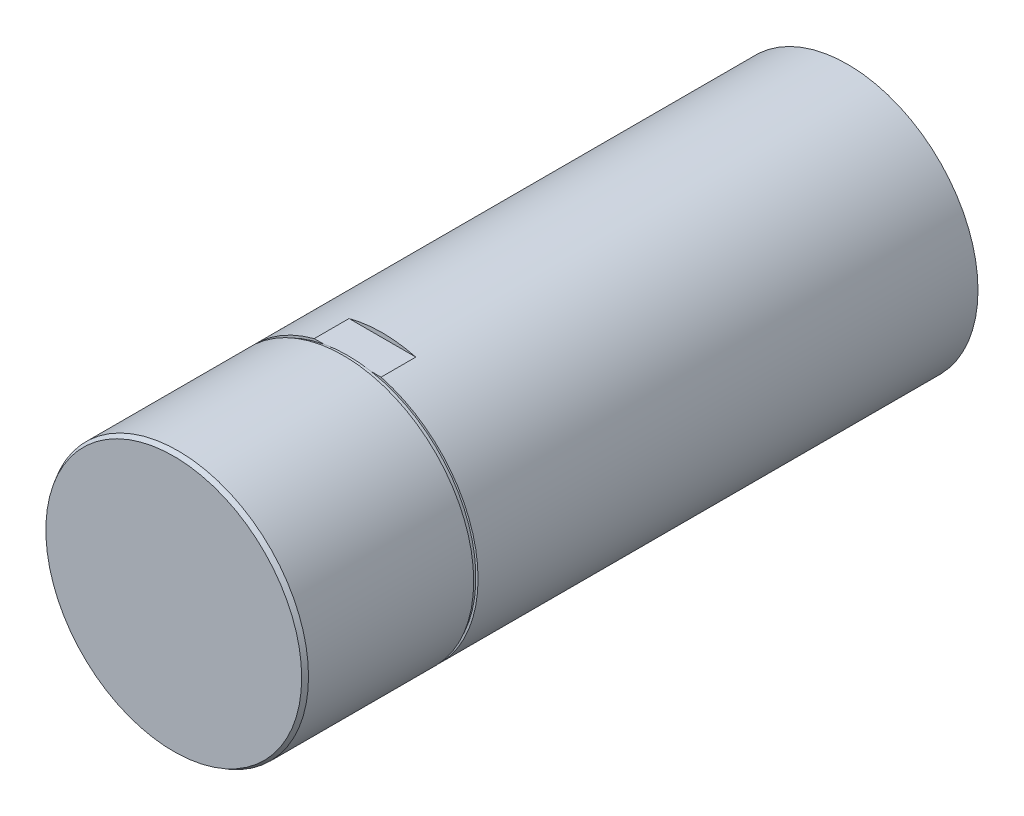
ISO-10303-21;
HEADER;
FILE_DESCRIPTION(('STEP AP214'),'2;1');
FILE_NAME('part.step','',(''),(''),'','','');
FILE_SCHEMA(('AUTOMOTIVE_DESIGN { 1 0 10303 214 1 1 1 1 }'));
ENDSEC;
DATA;
#1=APPLICATION_CONTEXT('core data for automotive mechanical design processes');
#2=APPLICATION_PROTOCOL_DEFINITION('international standard','automotive_design',2000,#1);
#3=PRODUCT_CONTEXT('',#1,'mechanical');
#4=PRODUCT('Part','Part','',(#3));
#5=PRODUCT_RELATED_PRODUCT_CATEGORY('part','',(#4));
#6=PRODUCT_DEFINITION_FORMATION('','',#4);
#7=PRODUCT_DEFINITION_CONTEXT('part definition',#1,'design');
#8=PRODUCT_DEFINITION('design','',#6,#7);
#9=PRODUCT_DEFINITION_SHAPE('','',#8);
#10=(LENGTH_UNIT() NAMED_UNIT(*) SI_UNIT(.MILLI.,.METRE.));
#11=(NAMED_UNIT(*) PLANE_ANGLE_UNIT() SI_UNIT($,.RADIAN.));
#12=(NAMED_UNIT(*) SI_UNIT($,.STERADIAN.) SOLID_ANGLE_UNIT());
#13=UNCERTAINTY_MEASURE_WITH_UNIT(LENGTH_MEASURE(1.E-05),#10,'distance_accuracy_value','');
#14=(GEOMETRIC_REPRESENTATION_CONTEXT(3) GLOBAL_UNCERTAINTY_ASSIGNED_CONTEXT((#13)) GLOBAL_UNIT_ASSIGNED_CONTEXT((#10,
#11,#12)) REPRESENTATION_CONTEXT('',''));
#15=CARTESIAN_POINT('',(0.,0.,0.));
#16=DIRECTION('',(0.,0.,1.));
#17=DIRECTION('',(1.,0.,0.));
#18=AXIS2_PLACEMENT_3D('',#15,#16,#17);
#19=CARTESIAN_POINT('',(0.,0.,15.));
#20=DIRECTION('',(0.,0.,1.));
#21=DIRECTION('',(1.,0.,0.));
#22=AXIS2_PLACEMENT_3D('',#19,#20,#21);
#23=PLANE('',#22);
#24=DIRECTION('',(1.,0.,0.));
#25=VECTOR('',#24,1.);
#26=CARTESIAN_POINT('',(-10.5,-29.,15.));
#27=LINE('',#26,#25);
#28=CARTESIAN_POINT('',(5.40832691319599,-29.,15.));
#29=VERTEX_POINT('',#28);
#30=CARTESIAN_POINT('',(7.6811457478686,-29.,15.));
#31=VERTEX_POINT('',#30);
#32=EDGE_CURVE('E98',#29,#31,#27,.T.);
#33=ORIENTED_EDGE('',*,*,#32,.T.);
#34=CARTESIAN_POINT('',(0.,0.,15.));
#35=DIRECTION('',(0.,0.,1.));
#36=DIRECTION('',(1.,0.,0.));
#37=AXIS2_PLACEMENT_3D('',#34,#35,#36);
#38=CIRCLE('',#37,30.);
#39=CARTESIAN_POINT('',(7.6811457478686,29.,15.));
#40=VERTEX_POINT('',#39);
#41=EDGE_CURVE('E112',#31,#40,#38,.T.);
#42=ORIENTED_EDGE('',*,*,#41,.T.);
#43=DIRECTION('',(1.,0.,0.));
#44=VECTOR('',#43,1.);
#45=CARTESIAN_POINT('',(-10.5,29.,15.));
#46=LINE('',#45,#44);
#47=CARTESIAN_POINT('',(5.40832691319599,29.,15.));
#48=VERTEX_POINT('',#47);
#49=EDGE_CURVE('E146',#48,#40,#46,.T.);
#50=ORIENTED_EDGE('',*,*,#49,.F.);
#51=CARTESIAN_POINT('',(0.,0.,15.));
#52=DIRECTION('',(0.,0.,1.));
#53=DIRECTION('',(1.,0.,0.));
#54=AXIS2_PLACEMENT_3D('',#51,#52,#53);
#55=CIRCLE('',#54,29.5);
#56=EDGE_CURVE('E140',#29,#48,#55,.T.);
#57=ORIENTED_EDGE('',*,*,#56,.F.);
#58=EDGE_LOOP('',(#33,#42,#50,#57));
#59=FACE_BOUND('',#58,.T.);
#60=ADVANCED_FACE('F35',(#59),#23,.T.);
#61=CARTESIAN_POINT('',(0.,0.,-100.));
#62=DIRECTION('',(0.,0.,1.));
#63=DIRECTION('',(1.,0.,0.));
#64=AXIS2_PLACEMENT_3D('',#61,#62,#63);
#65=CYLINDRICAL_SURFACE('',#64,30.);
#66=CARTESIAN_POINT('',(0.,0.,16.));
#67=DIRECTION('',(0.,0.,1.));
#68=DIRECTION('',(1.,0.,0.));
#69=AXIS2_PLACEMENT_3D('',#66,#67,#68);
#70=CIRCLE('',#69,30.);
#71=CARTESIAN_POINT('',(30.,0.,16.));
#72=VERTEX_POINT('',#71);
#73=EDGE_CURVE('E111',#72,#72,#70,.T.);
#74=ORIENTED_EDGE('',*,*,#73,.T.);
#75=EDGE_LOOP('',(#74));
#76=FACE_BOUND('',#75,.T.);
#77=CARTESIAN_POINT('',(0.,0.,54.));
#78=DIRECTION('',(0.,0.,1.));
#79=DIRECTION('',(1.,0.,0.));
#80=AXIS2_PLACEMENT_3D('',#77,#78,#79);
#81=CIRCLE('',#80,30.);
#82=CARTESIAN_POINT('',(30.,0.,54.));
#83=VERTEX_POINT('',#82);
#84=EDGE_CURVE('E125',#83,#83,#81,.F.);
#85=ORIENTED_EDGE('',*,*,#84,.T.);
#86=EDGE_LOOP('',(#85));
#87=FACE_BOUND('',#86,.T.);
#88=ADVANCED_FACE('F176',(#76,#87),#65,.T.);
#89=CARTESIAN_POINT('',(0.,0.,55.));
#90=DIRECTION('',(0.,0.,1.));
#91=DIRECTION('',(1.,0.,0.));
#92=AXIS2_PLACEMENT_3D('',#89,#90,#91);
#93=PLANE('',#92);
#94=CARTESIAN_POINT('',(0.,0.,55.));
#95=DIRECTION('',(0.,0.,1.));
#96=DIRECTION('',(1.,0.,0.));
#97=AXIS2_PLACEMENT_3D('',#94,#95,#96);
#98=CIRCLE('',#97,29.4226497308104);
#99=CARTESIAN_POINT('',(29.4226497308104,0.,55.));
#100=VERTEX_POINT('',#99);
#101=EDGE_CURVE('E122',#100,#100,#98,.T.);
#102=ORIENTED_EDGE('',*,*,#101,.T.);
#103=EDGE_LOOP('',(#102));
#104=FACE_BOUND('',#103,.T.);
#105=ADVANCED_FACE('F181',(#104),#93,.T.);
#106=CARTESIAN_POINT('',(0.,0.,55.));
#107=DIRECTION('',(0.,0.,-1.));
#108=DIRECTION('',(-1.,0.,0.));
#109=AXIS2_PLACEMENT_3D('',#106,#107,#108);
#110=CONICAL_SURFACE('',#109,29.4226497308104,0.523598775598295);
#111=ORIENTED_EDGE('',*,*,#84,.F.);
#112=EDGE_LOOP('',(#111));
#113=FACE_BOUND('',#112,.T.);
#114=ORIENTED_EDGE('',*,*,#101,.F.);
#115=EDGE_LOOP('',(#114));
#116=FACE_BOUND('',#115,.T.);
#117=ADVANCED_FACE('F37',(#113,#116),#110,.T.);
#118=CARTESIAN_POINT('',(0.,0.,16.));
#119=DIRECTION('',(0.,0.,1.));
#120=DIRECTION('',(1.,0.,0.));
#121=AXIS2_PLACEMENT_3D('',#118,#119,#120);
#122=PLANE('',#121);
#123=ORIENTED_EDGE('',*,*,#73,.F.);
#124=EDGE_LOOP('',(#123));
#125=FACE_BOUND('',#124,.T.);
#126=CARTESIAN_POINT('',(0.,0.,16.));
#127=DIRECTION('',(0.,0.,1.));
#128=DIRECTION('',(1.,0.,0.));
#129=AXIS2_PLACEMENT_3D('',#126,#127,#128);
#130=CIRCLE('',#129,29.5);
#131=CARTESIAN_POINT('',(29.5,0.,16.));
#132=VERTEX_POINT('',#131);
#133=EDGE_CURVE('E117',#132,#132,#130,.T.);
#134=ORIENTED_EDGE('',*,*,#133,.T.);
#135=EDGE_LOOP('',(#134));
#136=FACE_BOUND('',#135,.T.);
#137=ADVANCED_FACE('F186',(#125,#136),#122,.F.);
#138=CARTESIAN_POINT('',(-7.6811457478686,-29.,15.));
#139=VERTEX_POINT('',#138);
#140=CARTESIAN_POINT('',(-5.40832691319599,-29.,15.));
#141=VERTEX_POINT('',#140);
#142=EDGE_CURVE('E87',#139,#141,#27,.T.);
#143=ORIENTED_EDGE('',*,*,#142,.T.);
#144=CARTESIAN_POINT('',(-5.40832691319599,29.,15.));
#145=VERTEX_POINT('',#144);
#146=EDGE_CURVE('E150',#145,#141,#55,.T.);
#147=ORIENTED_EDGE('',*,*,#146,.F.);
#148=CARTESIAN_POINT('',(-7.6811457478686,29.,15.));
#149=VERTEX_POINT('',#148);
#150=EDGE_CURVE('E110',#149,#145,#46,.T.);
#151=ORIENTED_EDGE('',*,*,#150,.F.);
#152=EDGE_CURVE('E104',#149,#139,#38,.T.);
#153=ORIENTED_EDGE('',*,*,#152,.T.);
#154=EDGE_LOOP('',(#143,#147,#151,#153));
#155=FACE_BOUND('',#154,.T.);
#156=ADVANCED_FACE('F108',(#155),#23,.T.);
#157=CARTESIAN_POINT('',(0.,0.,16.));
#158=DIRECTION('',(0.,0.,-1.));
#159=DIRECTION('',(-1.,0.,0.));
#160=AXIS2_PLACEMENT_3D('',#157,#158,#159);
#161=CYLINDRICAL_SURFACE('',#160,29.5);
#162=ORIENTED_EDGE('',*,*,#133,.F.);
#163=EDGE_LOOP('',(#162));
#164=FACE_BOUND('',#163,.T.);
#165=EDGE_CURVE('E151',#48,#145,#55,.T.);
#166=ORIENTED_EDGE('',*,*,#165,.T.);
#167=ORIENTED_EDGE('',*,*,#146,.T.);
#168=CARTESIAN_POINT('',(0.,0.,15.));
#169=DIRECTION('',(0.,0.,1.));
#170=DIRECTION('',(1.,0.,0.));
#171=AXIS2_PLACEMENT_3D('',#168,#169,#170);
#172=CIRCLE('',#171,29.5);
#173=EDGE_CURVE('E155',#141,#29,#172,.T.);
#174=ORIENTED_EDGE('',*,*,#173,.T.);
#175=ORIENTED_EDGE('',*,*,#56,.T.);
#176=EDGE_LOOP('',(#166,#167,#174,#175));
#177=FACE_BOUND('',#176,.T.);
#178=ADVANCED_FACE('F161',(#164,#177),#161,.T.);
#179=CARTESIAN_POINT('',(0.,0.,-100.));
#180=DIRECTION('',(0.,0.,1.));
#181=DIRECTION('',(1.,0.,0.));
#182=AXIS2_PLACEMENT_3D('',#179,#180,#181);
#183=PLANE('',#182);
#184=CARTESIAN_POINT('',(0.,0.,-100.));
#185=DIRECTION('',(0.,0.,1.));
#186=DIRECTION('',(1.,0.,0.));
#187=AXIS2_PLACEMENT_3D('',#184,#185,#186);
#188=CIRCLE('',#187,30.);
#189=CARTESIAN_POINT('',(30.,0.,-100.));
#190=VERTEX_POINT('',#189);
#191=EDGE_CURVE('E115',#190,#190,#188,.T.);
#192=ORIENTED_EDGE('',*,*,#191,.F.);
#193=EDGE_LOOP('',(#192));
#194=FACE_BOUND('',#193,.T.);
#195=ADVANCED_FACE('F191',(#194),#183,.F.);
#196=DIRECTION('',(0.,0.,1.));
#197=VECTOR('',#196,1.);
#198=CARTESIAN_POINT('',(-7.6811457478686,-29.,-100.));
#199=LINE('',#198,#197);
#200=CARTESIAN_POINT('',(-7.6811457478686,-29.,7.));
#201=VERTEX_POINT('',#200);
#202=EDGE_CURVE('E11',#139,#201,#199,.F.);
#203=ORIENTED_EDGE('',*,*,#202,.F.);
#204=ORIENTED_EDGE('',*,*,#152,.F.);
#205=DIRECTION('',(0.,0.,1.));
#206=VECTOR('',#205,1.);
#207=CARTESIAN_POINT('',(-7.6811457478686,29.,-100.));
#208=LINE('',#207,#206);
#209=CARTESIAN_POINT('',(-7.6811457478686,29.,7.00000000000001));
#210=VERTEX_POINT('',#209);
#211=EDGE_CURVE('E128',#210,#149,#208,.T.);
#212=ORIENTED_EDGE('',*,*,#211,.F.);
#213=CARTESIAN_POINT('',(0.,0.,7.00000000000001));
#214=DIRECTION('',(0.,0.,-1.));
#215=DIRECTION('',(-1.,0.,0.));
#216=AXIS2_PLACEMENT_3D('',#213,#214,#215);
#217=CIRCLE('',#216,30.);
#218=CARTESIAN_POINT('',(7.6811457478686,29.,7.00000000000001));
#219=VERTEX_POINT('',#218);
#220=EDGE_CURVE('E130',#219,#210,#217,.F.);
#221=ORIENTED_EDGE('',*,*,#220,.F.);
#222=DIRECTION('',(0.,0.,1.));
#223=VECTOR('',#222,1.);
#224=CARTESIAN_POINT('',(7.6811457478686,29.,-100.));
#225=LINE('',#224,#223);
#226=EDGE_CURVE('E132',#40,#219,#225,.F.);
#227=ORIENTED_EDGE('',*,*,#226,.F.);
#228=ORIENTED_EDGE('',*,*,#41,.F.);
#229=DIRECTION('',(0.,0.,1.));
#230=VECTOR('',#229,1.);
#231=CARTESIAN_POINT('',(7.6811457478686,-29.,-100.));
#232=LINE('',#231,#230);
#233=CARTESIAN_POINT('',(7.6811457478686,-29.,7.));
#234=VERTEX_POINT('',#233);
#235=EDGE_CURVE('E43',#234,#31,#232,.T.);
#236=ORIENTED_EDGE('',*,*,#235,.F.);
#237=CARTESIAN_POINT('',(0.,0.,7.00000000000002));
#238=DIRECTION('',(0.,0.,-1.));
#239=DIRECTION('',(0.,1.,0.));
#240=AXIS2_PLACEMENT_3D('',#237,#238,#239);
#241=CIRCLE('',#240,30.);
#242=EDGE_CURVE('E106',#201,#234,#241,.F.);
#243=ORIENTED_EDGE('',*,*,#242,.F.);
#244=EDGE_LOOP('',(#203,#204,#212,#221,#227,#228,#236,#243));
#245=FACE_BOUND('',#244,.T.);
#246=ORIENTED_EDGE('',*,*,#191,.T.);
#247=EDGE_LOOP('',(#246));
#248=FACE_BOUND('',#247,.T.);
#249=ADVANCED_FACE('F101',(#245,#248),#65,.T.);
#250=CARTESIAN_POINT('',(-10.5,30.5,15.));
#251=DIRECTION('',(0.,0.,1.));
#252=DIRECTION('',(1.,0.,0.));
#253=AXIS2_PLACEMENT_3D('',#250,#251,#252);
#254=PLANE('',#253);
#255=EDGE_CURVE('E152',#145,#48,#46,.T.);
#256=ORIENTED_EDGE('',*,*,#255,.F.);
#257=ORIENTED_EDGE('',*,*,#165,.F.);
#258=EDGE_LOOP('',(#256,#257));
#259=FACE_BOUND('',#258,.T.);
#260=ADVANCED_FACE('F202',(#259),#254,.F.);
#261=CARTESIAN_POINT('',(-10.5,30.5,7.00000000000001));
#262=DIRECTION('',(0.,0.,-1.));
#263=DIRECTION('',(-1.,0.,0.));
#264=AXIS2_PLACEMENT_3D('',#261,#262,#263);
#265=PLANE('',#264);
#266=ORIENTED_EDGE('',*,*,#220,.T.);
#267=DIRECTION('',(1.,0.,0.));
#268=VECTOR('',#267,1.);
#269=CARTESIAN_POINT('',(-10.5,29.,7.00000000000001));
#270=LINE('',#269,#268);
#271=EDGE_CURVE('E56',#210,#219,#270,.T.);
#272=ORIENTED_EDGE('',*,*,#271,.T.);
#273=EDGE_LOOP('',(#266,#272));
#274=FACE_BOUND('',#273,.T.);
#275=ADVANCED_FACE('F148',(#274),#265,.F.);
#276=CARTESIAN_POINT('',(-10.5,29.,15.));
#277=DIRECTION('',(0.,-1.,0.));
#278=DIRECTION('',(0.,0.,-1.));
#279=AXIS2_PLACEMENT_3D('',#276,#277,#278);
#280=PLANE('',#279);
#281=ORIENTED_EDGE('',*,*,#226,.T.);
#282=ORIENTED_EDGE('',*,*,#271,.F.);
#283=ORIENTED_EDGE('',*,*,#211,.T.);
#284=ORIENTED_EDGE('',*,*,#150,.T.);
#285=ORIENTED_EDGE('',*,*,#255,.T.);
#286=ORIENTED_EDGE('',*,*,#49,.T.);
#287=EDGE_LOOP('',(#281,#282,#283,#284,#285,#286));
#288=FACE_BOUND('',#287,.T.);
#289=ADVANCED_FACE('F144',(#288),#280,.F.);
#290=CARTESIAN_POINT('',(-10.5,-29.,15.));
#291=DIRECTION('',(0.,0.,1.));
#292=DIRECTION('',(1.,0.,0.));
#293=AXIS2_PLACEMENT_3D('',#290,#291,#292);
#294=PLANE('',#293);
#295=EDGE_CURVE('E92',#141,#29,#27,.T.);
#296=ORIENTED_EDGE('',*,*,#295,.T.);
#297=ORIENTED_EDGE('',*,*,#173,.F.);
#298=EDGE_LOOP('',(#296,#297));
#299=FACE_BOUND('',#298,.T.);
#300=ADVANCED_FACE('F164',(#299),#294,.F.);
#301=CARTESIAN_POINT('',(-10.5,-29.,15.));
#302=DIRECTION('',(0.,1.,0.));
#303=DIRECTION('',(0.,0.,1.));
#304=AXIS2_PLACEMENT_3D('',#301,#302,#303);
#305=PLANE('',#304);
#306=ORIENTED_EDGE('',*,*,#202,.T.);
#307=DIRECTION('',(1.,0.,0.));
#308=VECTOR('',#307,1.);
#309=CARTESIAN_POINT('',(-10.5,-29.,7.));
#310=LINE('',#309,#308);
#311=EDGE_CURVE('E49',#201,#234,#310,.T.);
#312=ORIENTED_EDGE('',*,*,#311,.T.);
#313=ORIENTED_EDGE('',*,*,#235,.T.);
#314=ORIENTED_EDGE('',*,*,#32,.F.);
#315=ORIENTED_EDGE('',*,*,#295,.F.);
#316=ORIENTED_EDGE('',*,*,#142,.F.);
#317=EDGE_LOOP('',(#306,#312,#313,#314,#315,#316));
#318=FACE_BOUND('',#317,.T.);
#319=ADVANCED_FACE('F89',(#318),#305,.F.);
#320=CARTESIAN_POINT('',(-10.5,-29.,7.));
#321=DIRECTION('',(0.,0.,-1.));
#322=DIRECTION('',(0.,1.,0.));
#323=AXIS2_PLACEMENT_3D('',#320,#321,#322);
#324=PLANE('',#323);
#325=ORIENTED_EDGE('',*,*,#242,.T.);
#326=ORIENTED_EDGE('',*,*,#311,.F.);
#327=EDGE_LOOP('',(#325,#326));
#328=FACE_BOUND('',#327,.T.);
#329=ADVANCED_FACE('F171',(#328),#324,.F.);
#330=CLOSED_SHELL('',(#60,#88,#105,#117,#137,#156,#178,#195,#249,#260,#275,#289,#300,#319,#329));
#331=MANIFOLD_SOLID_BREP('B2',#330);
#332=ADVANCED_BREP_SHAPE_REPRESENTATION('',(#18,#331),#14);
#333=SHAPE_DEFINITION_REPRESENTATION(#9,#332);
ENDSEC;
END-ISO-10303-21;
